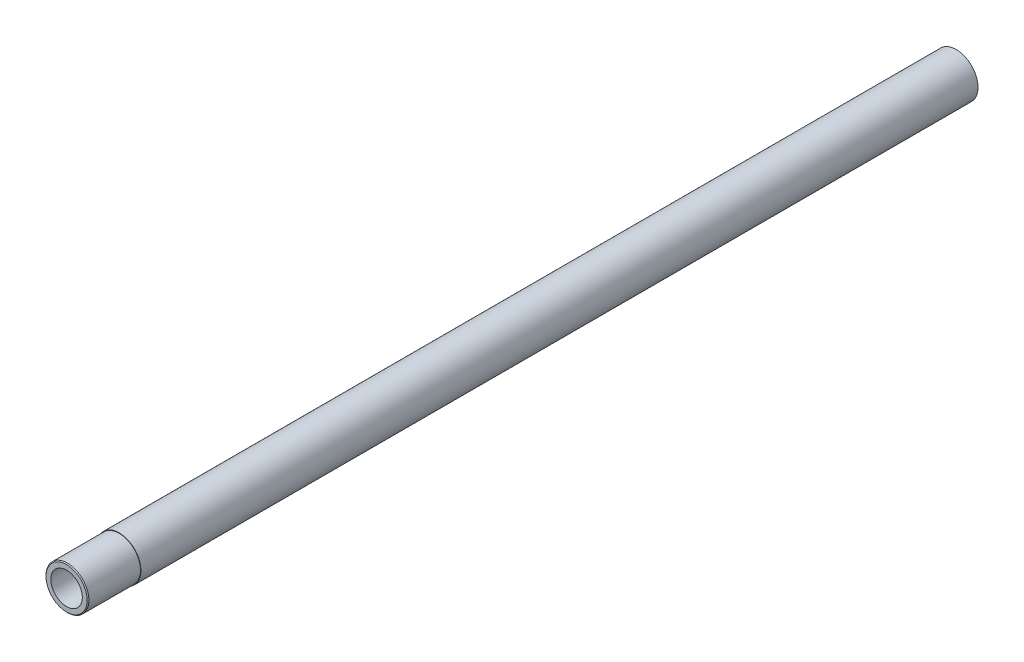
ISO-10303-21;
HEADER;
FILE_DESCRIPTION(('STEP AP214'),'2;1');
FILE_NAME('part.step','',(''),(''),'','','');
FILE_SCHEMA(('AUTOMOTIVE_DESIGN { 1 0 10303 214 1 1 1 1 }'));
ENDSEC;
DATA;
#1=APPLICATION_CONTEXT('core data for automotive mechanical design processes');
#2=APPLICATION_PROTOCOL_DEFINITION('international standard','automotive_design',2000,#1);
#3=PRODUCT_CONTEXT('',#1,'mechanical');
#4=PRODUCT('Part','Part','',(#3));
#5=PRODUCT_RELATED_PRODUCT_CATEGORY('part','',(#4));
#6=PRODUCT_DEFINITION_FORMATION('','',#4);
#7=PRODUCT_DEFINITION_CONTEXT('part definition',#1,'design');
#8=PRODUCT_DEFINITION('design','',#6,#7);
#9=PRODUCT_DEFINITION_SHAPE('','',#8);
#10=(LENGTH_UNIT() NAMED_UNIT(*) SI_UNIT(.MILLI.,.METRE.));
#11=(NAMED_UNIT(*) PLANE_ANGLE_UNIT() SI_UNIT($,.RADIAN.));
#12=(NAMED_UNIT(*) SI_UNIT($,.STERADIAN.) SOLID_ANGLE_UNIT());
#13=UNCERTAINTY_MEASURE_WITH_UNIT(LENGTH_MEASURE(1.E-05),#10,'distance_accuracy_value','');
#14=(GEOMETRIC_REPRESENTATION_CONTEXT(3) GLOBAL_UNCERTAINTY_ASSIGNED_CONTEXT((#13)) GLOBAL_UNIT_ASSIGNED_CONTEXT((#10,
#11,#12)) REPRESENTATION_CONTEXT('',''));
#15=CARTESIAN_POINT('',(0.,0.,0.));
#16=DIRECTION('',(0.,0.,1.));
#17=DIRECTION('',(1.,0.,0.));
#18=AXIS2_PLACEMENT_3D('',#15,#16,#17);
#19=CARTESIAN_POINT('',(4.90000000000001,0.,203.3));
#20=DIRECTION('',(0.,0.,1.));
#21=DIRECTION('',(1.,0.,0.));
#22=AXIS2_PLACEMENT_3D('',#19,#20,#21);
#23=PLANE('',#22);
#24=CARTESIAN_POINT('',(0.,0.,203.3));
#25=DIRECTION('',(0.,0.,1.));
#26=DIRECTION('',(1.,0.,0.));
#27=AXIS2_PLACEMENT_3D('',#24,#25,#26);
#28=CIRCLE('',#27,4.70000000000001);
#29=CARTESIAN_POINT('',(4.70000000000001,0.,203.3));
#30=VERTEX_POINT('',#29);
#31=EDGE_CURVE('E10',#30,#30,#28,.T.);
#32=ORIENTED_EDGE('',*,*,#31,.T.);
#33=EDGE_LOOP('',(#32));
#34=FACE_BOUND('',#33,.T.);
#35=CARTESIAN_POINT('',(0.,0.,203.3));
#36=DIRECTION('',(0.,0.,-1.));
#37=DIRECTION('',(-1.,0.,0.));
#38=AXIS2_PLACEMENT_3D('',#35,#36,#37);
#39=CIRCLE('',#38,3.60000000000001);
#40=CARTESIAN_POINT('',(-3.60000000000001,0.,203.3));
#41=VERTEX_POINT('',#40);
#42=EDGE_CURVE('E63',#41,#41,#39,.T.);
#43=ORIENTED_EDGE('',*,*,#42,.T.);
#44=EDGE_LOOP('',(#43));
#45=FACE_BOUND('',#44,.T.);
#46=ADVANCED_FACE('F31',(#34,#45),#23,.T.);
#47=CARTESIAN_POINT('',(0.,0.,290.300000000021));
#48=DIRECTION('',(0.,0.,-1.));
#49=DIRECTION('',(-1.,0.,0.));
#50=AXIS2_PLACEMENT_3D('',#47,#48,#49);
#51=CYLINDRICAL_SURFACE('',#50,4.90000000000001);
#52=CARTESIAN_POINT('',(0.,0.,203.1));
#53=DIRECTION('',(0.,0.,1.));
#54=DIRECTION('',(1.,0.,0.));
#55=AXIS2_PLACEMENT_3D('',#52,#53,#54);
#56=CIRCLE('',#55,4.90000000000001);
#57=CARTESIAN_POINT('',(4.90000000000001,0.,203.1));
#58=VERTEX_POINT('',#57);
#59=EDGE_CURVE('E38',#58,#58,#56,.F.);
#60=ORIENTED_EDGE('',*,*,#59,.T.);
#61=EDGE_LOOP('',(#60));
#62=FACE_BOUND('',#61,.T.);
#63=CARTESIAN_POINT('',(0.,0.,191.3));
#64=DIRECTION('',(0.,0.,-1.));
#65=DIRECTION('',(-1.,0.,0.));
#66=AXIS2_PLACEMENT_3D('',#63,#64,#65);
#67=CIRCLE('',#66,4.90000000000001);
#68=CARTESIAN_POINT('',(-4.90000000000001,0.,191.3));
#69=VERTEX_POINT('',#68);
#70=EDGE_CURVE('E42',#69,#69,#67,.T.);
#71=ORIENTED_EDGE('',*,*,#70,.F.);
#72=EDGE_LOOP('',(#71));
#73=FACE_BOUND('',#72,.T.);
#74=ADVANCED_FACE('F82',(#62,#73),#51,.T.);
#75=CARTESIAN_POINT('',(4.90000000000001,0.,191.3));
#76=DIRECTION('',(0.,0.,1.));
#77=DIRECTION('',(1.,0.,0.));
#78=AXIS2_PLACEMENT_3D('',#75,#76,#77);
#79=PLANE('',#78);
#80=ORIENTED_EDGE('',*,*,#70,.T.);
#81=EDGE_LOOP('',(#80));
#82=FACE_BOUND('',#81,.T.);
#83=CARTESIAN_POINT('',(0.,0.,191.3));
#84=DIRECTION('',(0.,0.,-1.));
#85=DIRECTION('',(-1.,0.,0.));
#86=AXIS2_PLACEMENT_3D('',#83,#84,#85);
#87=CIRCLE('',#86,5.00000000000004);
#88=CARTESIAN_POINT('',(-5.00000000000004,0.,191.3));
#89=VERTEX_POINT('',#88);
#90=EDGE_CURVE('E46',#89,#89,#87,.T.);
#91=ORIENTED_EDGE('',*,*,#90,.F.);
#92=EDGE_LOOP('',(#91));
#93=FACE_BOUND('',#92,.T.);
#94=ADVANCED_FACE('F86',(#82,#93),#79,.T.);
#95=CARTESIAN_POINT('',(0.,0.,290.300000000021));
#96=DIRECTION('',(0.,0.,-1.));
#97=DIRECTION('',(-1.,0.,0.));
#98=AXIS2_PLACEMENT_3D('',#95,#96,#97);
#99=CYLINDRICAL_SURFACE('',#98,5.00000000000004);
#100=ORIENTED_EDGE('',*,*,#90,.T.);
#101=EDGE_LOOP('',(#100));
#102=FACE_BOUND('',#101,.T.);
#103=CARTESIAN_POINT('',(0.,0.,0.));
#104=DIRECTION('',(0.,0.,-1.));
#105=DIRECTION('',(-1.,0.,0.));
#106=AXIS2_PLACEMENT_3D('',#103,#104,#105);
#107=CIRCLE('',#106,5.00000000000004);
#108=CARTESIAN_POINT('',(-5.00000000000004,0.,0.));
#109=VERTEX_POINT('',#108);
#110=EDGE_CURVE('E51',#109,#109,#107,.T.);
#111=ORIENTED_EDGE('',*,*,#110,.F.);
#112=EDGE_LOOP('',(#111));
#113=FACE_BOUND('',#112,.T.);
#114=ADVANCED_FACE('F91',(#102,#113),#99,.T.);
#115=CARTESIAN_POINT('',(3.50000000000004,0.,0.));
#116=DIRECTION('',(0.,0.,-1.));
#117=DIRECTION('',(-1.,0.,0.));
#118=AXIS2_PLACEMENT_3D('',#115,#116,#117);
#119=PLANE('',#118);
#120=ORIENTED_EDGE('',*,*,#110,.T.);
#121=EDGE_LOOP('',(#120));
#122=FACE_BOUND('',#121,.T.);
#123=CARTESIAN_POINT('',(0.,0.,0.));
#124=DIRECTION('',(0.,0.,-1.));
#125=DIRECTION('',(-1.,0.,0.));
#126=AXIS2_PLACEMENT_3D('',#123,#124,#125);
#127=CIRCLE('',#126,3.50000000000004);
#128=CARTESIAN_POINT('',(-3.50000000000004,0.,0.));
#129=VERTEX_POINT('',#128);
#130=EDGE_CURVE('E54',#129,#129,#127,.T.);
#131=ORIENTED_EDGE('',*,*,#130,.F.);
#132=EDGE_LOOP('',(#131));
#133=FACE_BOUND('',#132,.T.);
#134=ADVANCED_FACE('F95',(#122,#133),#119,.T.);
#135=CARTESIAN_POINT('',(0.,0.,290.300000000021));
#136=DIRECTION('',(0.,0.,-1.));
#137=DIRECTION('',(-1.,0.,0.));
#138=AXIS2_PLACEMENT_3D('',#135,#136,#137);
#139=CYLINDRICAL_SURFACE('',#138,3.50000000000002);
#140=ORIENTED_EDGE('',*,*,#130,.T.);
#141=EDGE_LOOP('',(#140));
#142=FACE_BOUND('',#141,.T.);
#143=CARTESIAN_POINT('',(0.,0.,181.3));
#144=DIRECTION('',(0.,0.,-1.));
#145=DIRECTION('',(-1.,0.,0.));
#146=AXIS2_PLACEMENT_3D('',#143,#144,#145);
#147=CIRCLE('',#146,3.50000000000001);
#148=CARTESIAN_POINT('',(-3.50000000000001,0.,181.3));
#149=VERTEX_POINT('',#148);
#150=EDGE_CURVE('E57',#149,#149,#147,.T.);
#151=ORIENTED_EDGE('',*,*,#150,.F.);
#152=EDGE_LOOP('',(#151));
#153=FACE_BOUND('',#152,.T.);
#154=ADVANCED_FACE('F78',(#142,#153),#139,.F.);
#155=CARTESIAN_POINT('',(3.60000000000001,0.,181.3));
#156=DIRECTION('',(0.,0.,1.));
#157=DIRECTION('',(1.,0.,0.));
#158=AXIS2_PLACEMENT_3D('',#155,#156,#157);
#159=PLANE('',#158);
#160=ORIENTED_EDGE('',*,*,#150,.T.);
#161=EDGE_LOOP('',(#160));
#162=FACE_BOUND('',#161,.T.);
#163=CARTESIAN_POINT('',(0.,0.,181.3));
#164=DIRECTION('',(0.,0.,-1.));
#165=DIRECTION('',(-1.,0.,0.));
#166=AXIS2_PLACEMENT_3D('',#163,#164,#165);
#167=CIRCLE('',#166,3.60000000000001);
#168=CARTESIAN_POINT('',(-3.60000000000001,0.,181.3));
#169=VERTEX_POINT('',#168);
#170=EDGE_CURVE('E60',#169,#169,#167,.T.);
#171=ORIENTED_EDGE('',*,*,#170,.F.);
#172=EDGE_LOOP('',(#171));
#173=FACE_BOUND('',#172,.T.);
#174=ADVANCED_FACE('F70',(#162,#173),#159,.T.);
#175=CARTESIAN_POINT('',(0.,0.,290.300000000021));
#176=DIRECTION('',(0.,0.,-1.));
#177=DIRECTION('',(-1.,0.,0.));
#178=AXIS2_PLACEMENT_3D('',#175,#176,#177);
#179=CYLINDRICAL_SURFACE('',#178,3.60000000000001);
#180=ORIENTED_EDGE('',*,*,#170,.T.);
#181=EDGE_LOOP('',(#180));
#182=FACE_BOUND('',#181,.T.);
#183=ORIENTED_EDGE('',*,*,#42,.F.);
#184=EDGE_LOOP('',(#183));
#185=FACE_BOUND('',#184,.T.);
#186=ADVANCED_FACE('F68',(#182,#185),#179,.F.);
#187=CARTESIAN_POINT('',(0.,0.,203.1));
#188=DIRECTION('',(0.,0.,-1.));
#189=DIRECTION('',(-1.,0.,0.));
#190=AXIS2_PLACEMENT_3D('',#187,#188,#189);
#191=CONICAL_SURFACE('',#190,4.90000000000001,0.78539816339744);
#192=ORIENTED_EDGE('',*,*,#31,.F.);
#193=EDGE_LOOP('',(#192));
#194=FACE_BOUND('',#193,.T.);
#195=ORIENTED_EDGE('',*,*,#59,.F.);
#196=EDGE_LOOP('',(#195));
#197=FACE_BOUND('',#196,.T.);
#198=ADVANCED_FACE('F33',(#194,#197),#191,.T.);
#199=CLOSED_SHELL('',(#46,#74,#94,#114,#134,#154,#174,#186,#198));
#200=MANIFOLD_SOLID_BREP('B2',#199);
#201=ADVANCED_BREP_SHAPE_REPRESENTATION('',(#18,#200),#14);
#202=SHAPE_DEFINITION_REPRESENTATION(#9,#201);
ENDSEC;
END-ISO-10303-21;
